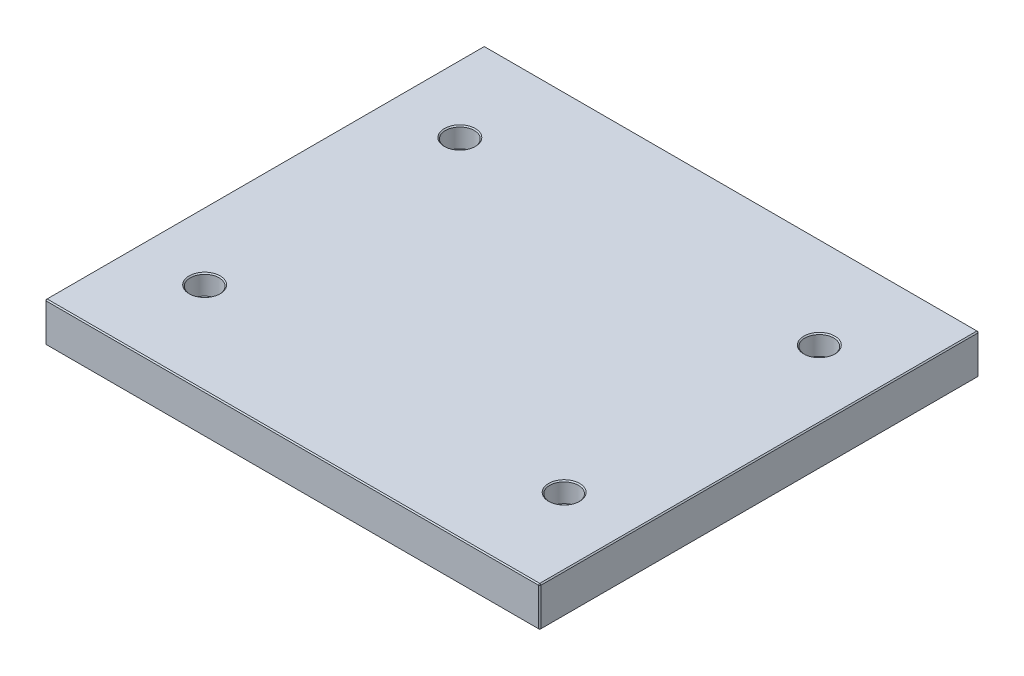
ISO-10303-21;
HEADER;
FILE_DESCRIPTION(('STEP AP214'),'2;1');
FILE_NAME('part.step','',(''),(''),'','','');
FILE_SCHEMA(('AUTOMOTIVE_DESIGN { 1 0 10303 214 1 1 1 1 }'));
ENDSEC;
DATA;
#1=APPLICATION_CONTEXT('core data for automotive mechanical design processes');
#2=APPLICATION_PROTOCOL_DEFINITION('international standard','automotive_design',2000,#1);
#3=PRODUCT_CONTEXT('',#1,'mechanical');
#4=PRODUCT('Part','Part','',(#3));
#5=PRODUCT_RELATED_PRODUCT_CATEGORY('part','',(#4));
#6=PRODUCT_DEFINITION_FORMATION('','',#4);
#7=PRODUCT_DEFINITION_CONTEXT('part definition',#1,'design');
#8=PRODUCT_DEFINITION('design','',#6,#7);
#9=PRODUCT_DEFINITION_SHAPE('','',#8);
#10=(LENGTH_UNIT() NAMED_UNIT(*) SI_UNIT(.MILLI.,.METRE.));
#11=(NAMED_UNIT(*) PLANE_ANGLE_UNIT() SI_UNIT($,.RADIAN.));
#12=(NAMED_UNIT(*) SI_UNIT($,.STERADIAN.) SOLID_ANGLE_UNIT());
#13=UNCERTAINTY_MEASURE_WITH_UNIT(LENGTH_MEASURE(1.E-05),#10,'distance_accuracy_value','');
#14=(GEOMETRIC_REPRESENTATION_CONTEXT(3) GLOBAL_UNCERTAINTY_ASSIGNED_CONTEXT((#13)) GLOBAL_UNIT_ASSIGNED_CONTEXT((#10,
#11,#12)) REPRESENTATION_CONTEXT('',''));
#15=CARTESIAN_POINT('',(0.,0.,0.));
#16=DIRECTION('',(0.,0.,1.));
#17=DIRECTION('',(1.,0.,0.));
#18=AXIS2_PLACEMENT_3D('',#15,#16,#17);
#19=CARTESIAN_POINT('',(-223.,36.,198.));
#20=DIRECTION('',(1.,0.,0.));
#21=DIRECTION('',(0.,0.,-1.));
#22=AXIS2_PLACEMENT_3D('',#19,#20,#21);
#23=PLANE('',#22);
#24=DIRECTION('',(0.,-1.,0.));
#25=VECTOR('',#24,1.);
#26=CARTESIAN_POINT('',(-223.,36.,-197.));
#27=LINE('',#26,#25);
#28=CARTESIAN_POINT('',(-223.,35.,-197.));
#29=VERTEX_POINT('',#28);
#30=CARTESIAN_POINT('',(-223.,1.,-197.));
#31=VERTEX_POINT('',#30);
#32=EDGE_CURVE('E115',#29,#31,#27,.T.);
#33=ORIENTED_EDGE('',*,*,#32,.T.);
#34=DIRECTION('',(0.,0.,1.));
#35=VECTOR('',#34,1.);
#36=CARTESIAN_POINT('',(-223.,1.,198.));
#37=LINE('',#36,#35);
#38=CARTESIAN_POINT('',(-223.,1.,197.));
#39=VERTEX_POINT('',#38);
#40=EDGE_CURVE('E111',#31,#39,#37,.T.);
#41=ORIENTED_EDGE('',*,*,#40,.T.);
#42=DIRECTION('',(0.,1.,0.));
#43=VECTOR('',#42,1.);
#44=CARTESIAN_POINT('',(-223.,36.,197.));
#45=LINE('',#44,#43);
#46=CARTESIAN_POINT('',(-223.,35.,197.));
#47=VERTEX_POINT('',#46);
#48=EDGE_CURVE('E104',#39,#47,#45,.T.);
#49=ORIENTED_EDGE('',*,*,#48,.T.);
#50=DIRECTION('',(0.,0.,-1.));
#51=VECTOR('',#50,1.);
#52=CARTESIAN_POINT('',(-223.,35.,-198.));
#53=LINE('',#52,#51);
#54=EDGE_CURVE('E108',#47,#29,#53,.T.);
#55=ORIENTED_EDGE('',*,*,#54,.T.);
#56=EDGE_LOOP('',(#33,#41,#49,#55));
#57=FACE_BOUND('',#56,.T.);
#58=ADVANCED_FACE('F16',(#57),#23,.F.);
#59=CARTESIAN_POINT('',(223.,36.,198.));
#60=DIRECTION('',(0.,0.,-1.));
#61=DIRECTION('',(-1.,0.,0.));
#62=AXIS2_PLACEMENT_3D('',#59,#60,#61);
#63=PLANE('',#62);
#64=DIRECTION('',(-1.,0.,0.));
#65=VECTOR('',#64,1.);
#66=CARTESIAN_POINT('',(-223.,35.,198.));
#67=LINE('',#66,#65);
#68=CARTESIAN_POINT('',(222.,35.,198.));
#69=VERTEX_POINT('',#68);
#70=CARTESIAN_POINT('',(-222.,35.,198.));
#71=VERTEX_POINT('',#70);
#72=EDGE_CURVE('E170',#69,#71,#67,.T.);
#73=ORIENTED_EDGE('',*,*,#72,.T.);
#74=DIRECTION('',(0.,-1.,0.));
#75=VECTOR('',#74,1.);
#76=CARTESIAN_POINT('',(-222.,36.,198.));
#77=LINE('',#76,#75);
#78=CARTESIAN_POINT('',(-222.,1.00000000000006,198.));
#79=VERTEX_POINT('',#78);
#80=EDGE_CURVE('E123',#71,#79,#77,.T.);
#81=ORIENTED_EDGE('',*,*,#80,.T.);
#82=DIRECTION('',(1.,0.,0.));
#83=VECTOR('',#82,1.);
#84=CARTESIAN_POINT('',(223.,1.00000000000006,198.));
#85=LINE('',#84,#83);
#86=CARTESIAN_POINT('',(222.,1.00000000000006,198.));
#87=VERTEX_POINT('',#86);
#88=EDGE_CURVE('E174',#79,#87,#85,.T.);
#89=ORIENTED_EDGE('',*,*,#88,.T.);
#90=DIRECTION('',(0.,1.,0.));
#91=VECTOR('',#90,1.);
#92=CARTESIAN_POINT('',(222.,36.,198.));
#93=LINE('',#92,#91);
#94=EDGE_CURVE('E172',#87,#69,#93,.T.);
#95=ORIENTED_EDGE('',*,*,#94,.T.);
#96=EDGE_LOOP('',(#73,#81,#89,#95));
#97=FACE_BOUND('',#96,.T.);
#98=ADVANCED_FACE('F317',(#97),#63,.F.);
#99=CARTESIAN_POINT('',(223.,36.,198.));
#100=DIRECTION('',(-1.,0.,0.));
#101=DIRECTION('',(0.,0.,1.));
#102=AXIS2_PLACEMENT_3D('',#99,#100,#101);
#103=PLANE('',#102);
#104=DIRECTION('',(0.,0.,-1.));
#105=VECTOR('',#104,1.);
#106=CARTESIAN_POINT('',(223.,1.00000000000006,198.));
#107=LINE('',#106,#105);
#108=CARTESIAN_POINT('',(223.,1.00000000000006,197.));
#109=VERTEX_POINT('',#108);
#110=CARTESIAN_POINT('',(223.,1.00000000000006,-197.));
#111=VERTEX_POINT('',#110);
#112=EDGE_CURVE('E165',#109,#111,#107,.T.);
#113=ORIENTED_EDGE('',*,*,#112,.T.);
#114=DIRECTION('',(0.,1.,0.));
#115=VECTOR('',#114,1.);
#116=CARTESIAN_POINT('',(223.,36.,-197.));
#117=LINE('',#116,#115);
#118=CARTESIAN_POINT('',(223.,35.,-197.));
#119=VERTEX_POINT('',#118);
#120=EDGE_CURVE('E167',#111,#119,#117,.T.);
#121=ORIENTED_EDGE('',*,*,#120,.T.);
#122=DIRECTION('',(0.,0.,1.));
#123=VECTOR('',#122,1.);
#124=CARTESIAN_POINT('',(223.,35.,198.));
#125=LINE('',#124,#123);
#126=CARTESIAN_POINT('',(223.,35.,197.));
#127=VERTEX_POINT('',#126);
#128=EDGE_CURVE('E161',#119,#127,#125,.T.);
#129=ORIENTED_EDGE('',*,*,#128,.T.);
#130=DIRECTION('',(0.,-1.,0.));
#131=VECTOR('',#130,1.);
#132=CARTESIAN_POINT('',(223.,36.,197.));
#133=LINE('',#132,#131);
#134=EDGE_CURVE('E163',#127,#109,#133,.T.);
#135=ORIENTED_EDGE('',*,*,#134,.T.);
#136=EDGE_LOOP('',(#113,#121,#129,#135));
#137=FACE_BOUND('',#136,.T.);
#138=ADVANCED_FACE('F323',(#137),#103,.F.);
#139=CARTESIAN_POINT('',(223.,36.,-198.));
#140=DIRECTION('',(0.,0.,1.));
#141=DIRECTION('',(1.,0.,0.));
#142=AXIS2_PLACEMENT_3D('',#139,#140,#141);
#143=PLANE('',#142);
#144=DIRECTION('',(0.,-1.,0.));
#145=VECTOR('',#144,1.);
#146=CARTESIAN_POINT('',(222.,36.,-198.));
#147=LINE('',#146,#145);
#148=CARTESIAN_POINT('',(222.,35.,-198.));
#149=VERTEX_POINT('',#148);
#150=CARTESIAN_POINT('',(222.,1.00000000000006,-198.));
#151=VERTEX_POINT('',#150);
#152=EDGE_CURVE('E154',#149,#151,#147,.T.);
#153=ORIENTED_EDGE('',*,*,#152,.T.);
#154=DIRECTION('',(-1.,0.,0.));
#155=VECTOR('',#154,1.);
#156=CARTESIAN_POINT('',(223.,1.00000000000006,-198.));
#157=LINE('',#156,#155);
#158=CARTESIAN_POINT('',(-222.,1.00000000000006,-198.));
#159=VERTEX_POINT('',#158);
#160=EDGE_CURVE('E159',#151,#159,#157,.T.);
#161=ORIENTED_EDGE('',*,*,#160,.T.);
#162=DIRECTION('',(0.,1.,0.));
#163=VECTOR('',#162,1.);
#164=CARTESIAN_POINT('',(-222.,36.,-198.));
#165=LINE('',#164,#163);
#166=CARTESIAN_POINT('',(-222.,35.,-198.));
#167=VERTEX_POINT('',#166);
#168=EDGE_CURVE('E156',#159,#167,#165,.T.);
#169=ORIENTED_EDGE('',*,*,#168,.T.);
#170=DIRECTION('',(1.,0.,0.));
#171=VECTOR('',#170,1.);
#172=CARTESIAN_POINT('',(223.,35.,-198.));
#173=LINE('',#172,#171);
#174=EDGE_CURVE('E152',#167,#149,#173,.T.);
#175=ORIENTED_EDGE('',*,*,#174,.T.);
#176=EDGE_LOOP('',(#153,#161,#169,#175));
#177=FACE_BOUND('',#176,.T.);
#178=ADVANCED_FACE('F465',(#177),#143,.F.);
#179=CARTESIAN_POINT('',(0.,36.,0.));
#180=DIRECTION('',(0.,1.,0.));
#181=DIRECTION('',(0.,0.,1.));
#182=AXIS2_PLACEMENT_3D('',#179,#180,#181);
#183=PLANE('',#182);
#184=CARTESIAN_POINT('',(-162.,36.,115.));
#185=DIRECTION('',(0.,1.,0.));
#186=DIRECTION('',(0.,0.,1.));
#187=AXIS2_PLACEMENT_3D('',#184,#185,#186);
#188=CIRCLE('',#187,14.);
#189=CARTESIAN_POINT('',(-162.,36.,129.));
#190=VERTEX_POINT('',#189);
#191=EDGE_CURVE('E290',#190,#190,#188,.F.);
#192=ORIENTED_EDGE('',*,*,#191,.T.);
#193=EDGE_LOOP('',(#192));
#194=FACE_BOUND('',#193,.T.);
#195=CARTESIAN_POINT('',(162.,36.,115.));
#196=DIRECTION('',(0.,1.,0.));
#197=DIRECTION('',(0.,0.,1.));
#198=AXIS2_PLACEMENT_3D('',#195,#196,#197);
#199=CIRCLE('',#198,14.);
#200=CARTESIAN_POINT('',(162.,36.,129.));
#201=VERTEX_POINT('',#200);
#202=EDGE_CURVE('E287',#201,#201,#199,.F.);
#203=ORIENTED_EDGE('',*,*,#202,.T.);
#204=EDGE_LOOP('',(#203));
#205=FACE_BOUND('',#204,.T.);
#206=CARTESIAN_POINT('',(162.,36.,-115.));
#207=DIRECTION('',(0.,1.,0.));
#208=DIRECTION('',(0.,0.,1.));
#209=AXIS2_PLACEMENT_3D('',#206,#207,#208);
#210=CIRCLE('',#209,14.);
#211=CARTESIAN_POINT('',(162.,36.,-101.));
#212=VERTEX_POINT('',#211);
#213=EDGE_CURVE('E284',#212,#212,#210,.F.);
#214=ORIENTED_EDGE('',*,*,#213,.T.);
#215=EDGE_LOOP('',(#214));
#216=FACE_BOUND('',#215,.T.);
#217=CARTESIAN_POINT('',(-162.,36.,-115.));
#218=DIRECTION('',(0.,1.,0.));
#219=DIRECTION('',(0.,0.,1.));
#220=AXIS2_PLACEMENT_3D('',#217,#218,#219);
#221=CIRCLE('',#220,14.);
#222=CARTESIAN_POINT('',(-162.,36.,-101.));
#223=VERTEX_POINT('',#222);
#224=EDGE_CURVE('E281',#223,#223,#221,.F.);
#225=ORIENTED_EDGE('',*,*,#224,.T.);
#226=EDGE_LOOP('',(#225));
#227=FACE_BOUND('',#226,.T.);
#228=DIRECTION('',(0.,0.,-1.));
#229=VECTOR('',#228,1.);
#230=CARTESIAN_POINT('',(222.,36.,-198.));
#231=LINE('',#230,#229);
#232=CARTESIAN_POINT('',(222.,36.,197.));
#233=VERTEX_POINT('',#232);
#234=CARTESIAN_POINT('',(222.,36.,-197.));
#235=VERTEX_POINT('',#234);
#236=EDGE_CURVE('E31',#233,#235,#231,.T.);
#237=ORIENTED_EDGE('',*,*,#236,.T.);
#238=DIRECTION('',(-1.,0.,0.));
#239=VECTOR('',#238,1.);
#240=CARTESIAN_POINT('',(-223.,36.,-197.));
#241=LINE('',#240,#239);
#242=CARTESIAN_POINT('',(-222.,36.,-197.));
#243=VERTEX_POINT('',#242);
#244=EDGE_CURVE('E190',#235,#243,#241,.T.);
#245=ORIENTED_EDGE('',*,*,#244,.T.);
#246=DIRECTION('',(0.,0.,1.));
#247=VECTOR('',#246,1.);
#248=CARTESIAN_POINT('',(-222.,36.,198.));
#249=LINE('',#248,#247);
#250=CARTESIAN_POINT('',(-222.,36.,197.));
#251=VERTEX_POINT('',#250);
#252=EDGE_CURVE('E186',#243,#251,#249,.T.);
#253=ORIENTED_EDGE('',*,*,#252,.T.);
#254=DIRECTION('',(1.,0.,0.));
#255=VECTOR('',#254,1.);
#256=CARTESIAN_POINT('',(223.,36.,197.));
#257=LINE('',#256,#255);
#258=EDGE_CURVE('E36',#251,#233,#257,.T.);
#259=ORIENTED_EDGE('',*,*,#258,.T.);
#260=EDGE_LOOP('',(#237,#245,#253,#259));
#261=FACE_BOUND('',#260,.T.);
#262=ADVANCED_FACE('F462',(#194,#205,#216,#227,#261),#183,.T.);
#263=CARTESIAN_POINT('',(0.,0.,0.));
#264=DIRECTION('',(0.,1.,0.));
#265=DIRECTION('',(0.,0.,1.));
#266=AXIS2_PLACEMENT_3D('',#263,#264,#265);
#267=PLANE('',#266);
#268=CARTESIAN_POINT('',(162.,0.,-115.));
#269=DIRECTION('',(0.,1.,0.));
#270=DIRECTION('',(0.,0.,1.));
#271=AXIS2_PLACEMENT_3D('',#268,#269,#270);
#272=CIRCLE('',#271,10.);
#273=CARTESIAN_POINT('',(162.,0.,-105.));
#274=VERTEX_POINT('',#273);
#275=EDGE_CURVE('E263',#274,#274,#272,.T.);
#276=ORIENTED_EDGE('',*,*,#275,.T.);
#277=EDGE_LOOP('',(#276));
#278=FACE_BOUND('',#277,.T.);
#279=CARTESIAN_POINT('',(162.,0.,115.));
#280=DIRECTION('',(0.,1.,0.));
#281=DIRECTION('',(0.,0.,1.));
#282=AXIS2_PLACEMENT_3D('',#279,#280,#281);
#283=CIRCLE('',#282,10.);
#284=CARTESIAN_POINT('',(162.,0.,125.));
#285=VERTEX_POINT('',#284);
#286=EDGE_CURVE('E260',#285,#285,#283,.T.);
#287=ORIENTED_EDGE('',*,*,#286,.T.);
#288=EDGE_LOOP('',(#287));
#289=FACE_BOUND('',#288,.T.);
#290=CARTESIAN_POINT('',(-162.,0.,115.));
#291=DIRECTION('',(0.,1.,0.));
#292=DIRECTION('',(0.,0.,1.));
#293=AXIS2_PLACEMENT_3D('',#290,#291,#292);
#294=CIRCLE('',#293,10.);
#295=CARTESIAN_POINT('',(-162.,0.,125.));
#296=VERTEX_POINT('',#295);
#297=EDGE_CURVE('E257',#296,#296,#294,.T.);
#298=ORIENTED_EDGE('',*,*,#297,.T.);
#299=EDGE_LOOP('',(#298));
#300=FACE_BOUND('',#299,.T.);
#301=CARTESIAN_POINT('',(-162.,0.,-115.));
#302=DIRECTION('',(0.,1.,0.));
#303=DIRECTION('',(0.,0.,1.));
#304=AXIS2_PLACEMENT_3D('',#301,#302,#303);
#305=CIRCLE('',#304,10.);
#306=CARTESIAN_POINT('',(-162.,0.,-105.));
#307=VERTEX_POINT('',#306);
#308=EDGE_CURVE('E192',#307,#307,#305,.T.);
#309=ORIENTED_EDGE('',*,*,#308,.T.);
#310=EDGE_LOOP('',(#309));
#311=FACE_BOUND('',#310,.T.);
#312=DIRECTION('',(0.,0.,1.));
#313=VECTOR('',#312,1.);
#314=CARTESIAN_POINT('',(222.,0.,0.));
#315=LINE('',#314,#313);
#316=CARTESIAN_POINT('',(222.,0.,-197.));
#317=VERTEX_POINT('',#316);
#318=CARTESIAN_POINT('',(222.,0.,197.));
#319=VERTEX_POINT('',#318);
#320=EDGE_CURVE('E177',#317,#319,#315,.T.);
#321=ORIENTED_EDGE('',*,*,#320,.T.);
#322=DIRECTION('',(-1.,0.,0.));
#323=VECTOR('',#322,1.);
#324=CARTESIAN_POINT('',(0.,0.,197.));
#325=LINE('',#324,#323);
#326=CARTESIAN_POINT('',(-222.,0.,197.));
#327=VERTEX_POINT('',#326);
#328=EDGE_CURVE('E183',#319,#327,#325,.T.);
#329=ORIENTED_EDGE('',*,*,#328,.T.);
#330=DIRECTION('',(0.,0.,-1.));
#331=VECTOR('',#330,1.);
#332=CARTESIAN_POINT('',(-222.,0.,0.));
#333=LINE('',#332,#331);
#334=CARTESIAN_POINT('',(-222.,0.,-197.));
#335=VERTEX_POINT('',#334);
#336=EDGE_CURVE('E181',#327,#335,#333,.T.);
#337=ORIENTED_EDGE('',*,*,#336,.T.);
#338=DIRECTION('',(1.,0.,0.));
#339=VECTOR('',#338,1.);
#340=CARTESIAN_POINT('',(0.,0.,-197.));
#341=LINE('',#340,#339);
#342=EDGE_CURVE('E179',#335,#317,#341,.T.);
#343=ORIENTED_EDGE('',*,*,#342,.T.);
#344=EDGE_LOOP('',(#321,#329,#337,#343));
#345=FACE_BOUND('',#344,.T.);
#346=ADVANCED_FACE('F402',(#278,#289,#300,#311,#345),#267,.F.);
#347=CARTESIAN_POINT('',(223.,36.,197.));
#348=DIRECTION('',(-0.707106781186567,0.,-0.707106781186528));
#349=DIRECTION('',(0.,-1.,0.));
#350=AXIS2_PLACEMENT_3D('',#347,#348,#349);
#351=PLANE('',#350);
#352=DIRECTION('',(-0.707106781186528,0.,0.707106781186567));
#353=VECTOR('',#352,1.);
#354=CARTESIAN_POINT('',(222.,35.,198.));
#355=LINE('',#354,#353);
#356=EDGE_CURVE('E141',#69,#127,#355,.F.);
#357=ORIENTED_EDGE('',*,*,#356,.F.);
#358=ORIENTED_EDGE('',*,*,#94,.F.);
#359=DIRECTION('',(0.707106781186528,0.,-0.707106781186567));
#360=VECTOR('',#359,1.);
#361=CARTESIAN_POINT('',(222.,1.00000000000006,198.));
#362=LINE('',#361,#360);
#363=EDGE_CURVE('E144',#109,#87,#362,.F.);
#364=ORIENTED_EDGE('',*,*,#363,.F.);
#365=ORIENTED_EDGE('',*,*,#134,.F.);
#366=EDGE_LOOP('',(#357,#358,#364,#365));
#367=FACE_BOUND('',#366,.T.);
#368=ADVANCED_FACE('F398',(#367),#351,.F.);
#369=CARTESIAN_POINT('',(222.,35.,198.));
#370=DIRECTION('',(0.577350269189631,0.577350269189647,0.577350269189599));
#371=DIRECTION('',(-0.707106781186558,0.707106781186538,0.));
#372=AXIS2_PLACEMENT_3D('',#369,#370,#371);
#373=PLANE('',#372);
#374=DIRECTION('',(0.,-0.707106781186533,0.707106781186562));
#375=VECTOR('',#374,1.);
#376=CARTESIAN_POINT('',(222.,35.,198.));
#377=LINE('',#376,#375);
#378=EDGE_CURVE('E235',#69,#233,#377,.F.);
#379=ORIENTED_EDGE('',*,*,#378,.F.);
#380=ORIENTED_EDGE('',*,*,#356,.T.);
#381=DIRECTION('',(-0.707106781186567,0.707106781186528,0.));
#382=VECTOR('',#381,1.);
#383=CARTESIAN_POINT('',(222.5,35.5,197.));
#384=LINE('',#383,#382);
#385=EDGE_CURVE('E237',#233,#127,#384,.F.);
#386=ORIENTED_EDGE('',*,*,#385,.F.);
#387=EDGE_LOOP('',(#379,#380,#386));
#388=FACE_BOUND('',#387,.T.);
#389=ADVANCED_FACE('F394',(#388),#373,.T.);
#390=CARTESIAN_POINT('',(222.,1.00000000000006,198.));
#391=DIRECTION('',(0.577350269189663,-0.577350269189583,0.577350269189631));
#392=DIRECTION('',(0.707106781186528,0.,-0.707106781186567));
#393=AXIS2_PLACEMENT_3D('',#390,#391,#392);
#394=PLANE('',#393);
#395=DIRECTION('',(-0.707106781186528,-0.707106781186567,0.));
#396=VECTOR('',#395,1.);
#397=CARTESIAN_POINT('',(222.5,0.500000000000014,197.));
#398=LINE('',#397,#396);
#399=EDGE_CURVE('E229',#109,#319,#398,.T.);
#400=ORIENTED_EDGE('',*,*,#399,.F.);
#401=ORIENTED_EDGE('',*,*,#363,.T.);
#402=DIRECTION('',(0.,0.707106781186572,0.707106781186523));
#403=VECTOR('',#402,1.);
#404=CARTESIAN_POINT('',(222.,1.00000000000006,198.));
#405=LINE('',#404,#403);
#406=EDGE_CURVE('E232',#319,#87,#405,.T.);
#407=ORIENTED_EDGE('',*,*,#406,.F.);
#408=EDGE_LOOP('',(#400,#401,#407));
#409=FACE_BOUND('',#408,.T.);
#410=ADVANCED_FACE('F390',(#409),#394,.T.);
#411=CARTESIAN_POINT('',(222.,36.,0.));
#412=DIRECTION('',(0.707106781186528,0.707106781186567,0.));
#413=DIRECTION('',(0.,0.,1.));
#414=AXIS2_PLACEMENT_3D('',#411,#412,#413);
#415=PLANE('',#414);
#416=ORIENTED_EDGE('',*,*,#385,.T.);
#417=ORIENTED_EDGE('',*,*,#128,.F.);
#418=DIRECTION('',(0.707106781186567,-0.707106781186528,0.));
#419=VECTOR('',#418,1.);
#420=CARTESIAN_POINT('',(223.,35.,-197.));
#421=LINE('',#420,#419);
#422=EDGE_CURVE('E224',#235,#119,#421,.T.);
#423=ORIENTED_EDGE('',*,*,#422,.F.);
#424=ORIENTED_EDGE('',*,*,#236,.F.);
#425=EDGE_LOOP('',(#416,#417,#423,#424));
#426=FACE_BOUND('',#425,.T.);
#427=ADVANCED_FACE('F386',(#426),#415,.T.);
#428=CARTESIAN_POINT('',(0.,36.,197.));
#429=DIRECTION('',(0.,0.707106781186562,0.707106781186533));
#430=DIRECTION('',(-1.,0.,0.));
#431=AXIS2_PLACEMENT_3D('',#428,#429,#430);
#432=PLANE('',#431);
#433=ORIENTED_EDGE('',*,*,#378,.T.);
#434=ORIENTED_EDGE('',*,*,#258,.F.);
#435=DIRECTION('',(0.,0.707106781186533,-0.707106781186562));
#436=VECTOR('',#435,1.);
#437=CARTESIAN_POINT('',(-222.,35.5,197.5));
#438=LINE('',#437,#436);
#439=EDGE_CURVE('E127',#71,#251,#438,.T.);
#440=ORIENTED_EDGE('',*,*,#439,.F.);
#441=ORIENTED_EDGE('',*,*,#72,.F.);
#442=EDGE_LOOP('',(#433,#434,#440,#441));
#443=FACE_BOUND('',#442,.T.);
#444=ADVANCED_FACE('F383',(#443),#432,.T.);
#445=CARTESIAN_POINT('',(-222.,36.,198.));
#446=DIRECTION('',(0.707106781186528,0.,-0.707106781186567));
#447=DIRECTION('',(0.,-1.,0.));
#448=AXIS2_PLACEMENT_3D('',#445,#446,#447);
#449=PLANE('',#448);
#450=DIRECTION('',(0.707106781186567,0.,0.707106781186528));
#451=VECTOR('',#450,1.);
#452=CARTESIAN_POINT('',(-222.,1.00000000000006,198.));
#453=LINE('',#452,#451);
#454=EDGE_CURVE('E128',#79,#39,#453,.F.);
#455=ORIENTED_EDGE('',*,*,#454,.F.);
#456=ORIENTED_EDGE('',*,*,#80,.F.);
#457=DIRECTION('',(-0.707106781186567,0.,-0.707106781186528));
#458=VECTOR('',#457,1.);
#459=CARTESIAN_POINT('',(-223.,35.,197.));
#460=LINE('',#459,#458);
#461=EDGE_CURVE('E119',#47,#71,#460,.F.);
#462=ORIENTED_EDGE('',*,*,#461,.F.);
#463=ORIENTED_EDGE('',*,*,#48,.F.);
#464=EDGE_LOOP('',(#455,#456,#462,#463));
#465=FACE_BOUND('',#464,.T.);
#466=ADVANCED_FACE('F121',(#465),#449,.F.);
#467=CARTESIAN_POINT('',(223.,1.00000000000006,198.));
#468=DIRECTION('',(0.,0.707106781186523,-0.707106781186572));
#469=DIRECTION('',(1.,0.,0.));
#470=AXIS2_PLACEMENT_3D('',#467,#468,#469);
#471=PLANE('',#470);
#472=ORIENTED_EDGE('',*,*,#406,.T.);
#473=ORIENTED_EDGE('',*,*,#88,.F.);
#474=DIRECTION('',(0.,-0.707106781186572,-0.707106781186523));
#475=VECTOR('',#474,1.);
#476=CARTESIAN_POINT('',(-222.,1.00000000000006,198.));
#477=LINE('',#476,#475);
#478=EDGE_CURVE('E220',#327,#79,#477,.F.);
#479=ORIENTED_EDGE('',*,*,#478,.F.);
#480=ORIENTED_EDGE('',*,*,#328,.F.);
#481=EDGE_LOOP('',(#472,#473,#479,#480));
#482=FACE_BOUND('',#481,.T.);
#483=ADVANCED_FACE('F376',(#482),#471,.F.);
#484=CARTESIAN_POINT('',(223.,1.00000000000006,198.));
#485=DIRECTION('',(-0.707106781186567,0.707106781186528,0.));
#486=DIRECTION('',(0.,0.,-1.));
#487=AXIS2_PLACEMENT_3D('',#484,#485,#486);
#488=PLANE('',#487);
#489=ORIENTED_EDGE('',*,*,#399,.T.);
#490=ORIENTED_EDGE('',*,*,#320,.F.);
#491=DIRECTION('',(0.707106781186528,0.707106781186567,0.));
#492=VECTOR('',#491,1.);
#493=CARTESIAN_POINT('',(222.5,0.500000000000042,-197.));
#494=LINE('',#493,#492);
#495=EDGE_CURVE('E217',#111,#317,#494,.F.);
#496=ORIENTED_EDGE('',*,*,#495,.F.);
#497=ORIENTED_EDGE('',*,*,#112,.F.);
#498=EDGE_LOOP('',(#489,#490,#496,#497));
#499=FACE_BOUND('',#498,.T.);
#500=ADVANCED_FACE('F372',(#499),#488,.F.);
#501=CARTESIAN_POINT('',(222.,36.,-198.));
#502=DIRECTION('',(-0.707106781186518,0.,0.707106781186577));
#503=DIRECTION('',(0.,-1.,0.));
#504=AXIS2_PLACEMENT_3D('',#501,#502,#503);
#505=PLANE('',#504);
#506=DIRECTION('',(0.707106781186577,0.,0.707106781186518));
#507=VECTOR('',#506,1.);
#508=CARTESIAN_POINT('',(223.,35.,-197.));
#509=LINE('',#508,#507);
#510=EDGE_CURVE('E226',#119,#149,#509,.F.);
#511=ORIENTED_EDGE('',*,*,#510,.F.);
#512=ORIENTED_EDGE('',*,*,#120,.F.);
#513=DIRECTION('',(-0.707106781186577,0.,-0.707106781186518));
#514=VECTOR('',#513,1.);
#515=CARTESIAN_POINT('',(222.,1.00000000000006,-198.));
#516=LINE('',#515,#514);
#517=EDGE_CURVE('E214',#151,#111,#516,.F.);
#518=ORIENTED_EDGE('',*,*,#517,.F.);
#519=ORIENTED_EDGE('',*,*,#152,.F.);
#520=EDGE_LOOP('',(#511,#512,#518,#519));
#521=FACE_BOUND('',#520,.T.);
#522=ADVANCED_FACE('F368',(#521),#505,.F.);
#523=CARTESIAN_POINT('',(223.,35.,-197.));
#524=DIRECTION('',(0.577350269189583,0.577350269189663,-0.577350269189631));
#525=DIRECTION('',(0.,0.707106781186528,0.707106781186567));
#526=AXIS2_PLACEMENT_3D('',#523,#524,#525);
#527=PLANE('',#526);
#528=ORIENTED_EDGE('',*,*,#422,.T.);
#529=ORIENTED_EDGE('',*,*,#510,.T.);
#530=DIRECTION('',(0.,0.707106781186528,0.707106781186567));
#531=VECTOR('',#530,1.);
#532=CARTESIAN_POINT('',(222.,35.5,-197.5));
#533=LINE('',#532,#531);
#534=EDGE_CURVE('E135',#235,#149,#533,.F.);
#535=ORIENTED_EDGE('',*,*,#534,.F.);
#536=EDGE_LOOP('',(#528,#529,#535));
#537=FACE_BOUND('',#536,.T.);
#538=ADVANCED_FACE('F365',(#537),#527,.T.);
#539=CARTESIAN_POINT('',(-223.,35.,197.));
#540=DIRECTION('',(-0.577350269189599,0.577350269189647,0.577350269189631));
#541=DIRECTION('',(0.,-0.707106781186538,0.707106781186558));
#542=AXIS2_PLACEMENT_3D('',#539,#540,#541);
#543=PLANE('',#542);
#544=ORIENTED_EDGE('',*,*,#461,.T.);
#545=ORIENTED_EDGE('',*,*,#439,.T.);
#546=DIRECTION('',(-0.707106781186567,-0.707106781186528,0.));
#547=VECTOR('',#546,1.);
#548=CARTESIAN_POINT('',(-223.,35.,197.));
#549=LINE('',#548,#547);
#550=EDGE_CURVE('E131',#47,#251,#549,.F.);
#551=ORIENTED_EDGE('',*,*,#550,.F.);
#552=EDGE_LOOP('',(#544,#545,#551));
#553=FACE_BOUND('',#552,.T.);
#554=ADVANCED_FACE('F132',(#553),#543,.T.);
#555=CARTESIAN_POINT('',(-222.,1.00000000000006,198.));
#556=DIRECTION('',(-0.577350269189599,-0.577350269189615,0.577350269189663));
#557=DIRECTION('',(0.,-0.707106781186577,-0.707106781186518));
#558=AXIS2_PLACEMENT_3D('',#555,#556,#557);
#559=PLANE('',#558);
#560=ORIENTED_EDGE('',*,*,#478,.T.);
#561=ORIENTED_EDGE('',*,*,#454,.T.);
#562=DIRECTION('',(-0.707106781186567,0.707106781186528,0.));
#563=VECTOR('',#562,1.);
#564=CARTESIAN_POINT('',(-222.5,0.499999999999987,197.));
#565=LINE('',#564,#563);
#566=EDGE_CURVE('E136',#327,#39,#565,.T.);
#567=ORIENTED_EDGE('',*,*,#566,.F.);
#568=EDGE_LOOP('',(#560,#561,#567));
#569=FACE_BOUND('',#568,.T.);
#570=ADVANCED_FACE('F358',(#569),#559,.T.);
#571=CARTESIAN_POINT('',(222.,1.00000000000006,-198.));
#572=DIRECTION('',(0.577350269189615,-0.577350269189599,-0.577350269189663));
#573=DIRECTION('',(-0.707106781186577,0.,-0.707106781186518));
#574=AXIS2_PLACEMENT_3D('',#571,#572,#573);
#575=PLANE('',#574);
#576=ORIENTED_EDGE('',*,*,#517,.T.);
#577=ORIENTED_EDGE('',*,*,#495,.T.);
#578=DIRECTION('',(0.,-0.707106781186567,0.707106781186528));
#579=VECTOR('',#578,1.);
#580=CARTESIAN_POINT('',(222.,1.00000000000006,-198.));
#581=LINE('',#580,#579);
#582=EDGE_CURVE('E207',#151,#317,#581,.T.);
#583=ORIENTED_EDGE('',*,*,#582,.F.);
#584=EDGE_LOOP('',(#576,#577,#583));
#585=FACE_BOUND('',#584,.T.);
#586=ADVANCED_FACE('F354',(#585),#575,.T.);
#587=CARTESIAN_POINT('',(0.,36.,-197.));
#588=DIRECTION('',(0.,0.707106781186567,-0.707106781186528));
#589=DIRECTION('',(1.,0.,0.));
#590=AXIS2_PLACEMENT_3D('',#587,#588,#589);
#591=PLANE('',#590);
#592=ORIENTED_EDGE('',*,*,#534,.T.);
#593=ORIENTED_EDGE('',*,*,#174,.F.);
#594=DIRECTION('',(0.,-0.707106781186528,-0.707106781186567));
#595=VECTOR('',#594,1.);
#596=CARTESIAN_POINT('',(-222.,35.,-198.));
#597=LINE('',#596,#595);
#598=EDGE_CURVE('E204',#243,#167,#597,.T.);
#599=ORIENTED_EDGE('',*,*,#598,.F.);
#600=ORIENTED_EDGE('',*,*,#244,.F.);
#601=EDGE_LOOP('',(#592,#593,#599,#600));
#602=FACE_BOUND('',#601,.T.);
#603=ADVANCED_FACE('F351',(#602),#591,.T.);
#604=CARTESIAN_POINT('',(-222.,36.,0.));
#605=DIRECTION('',(-0.707106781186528,0.707106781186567,0.));
#606=DIRECTION('',(0.,0.,-1.));
#607=AXIS2_PLACEMENT_3D('',#604,#605,#606);
#608=PLANE('',#607);
#609=ORIENTED_EDGE('',*,*,#550,.T.);
#610=ORIENTED_EDGE('',*,*,#252,.F.);
#611=DIRECTION('',(0.707106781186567,0.707106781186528,0.));
#612=VECTOR('',#611,1.);
#613=CARTESIAN_POINT('',(-222.5,35.5,-197.));
#614=LINE('',#613,#612);
#615=EDGE_CURVE('E139',#29,#243,#614,.T.);
#616=ORIENTED_EDGE('',*,*,#615,.F.);
#617=ORIENTED_EDGE('',*,*,#54,.F.);
#618=EDGE_LOOP('',(#609,#610,#616,#617));
#619=FACE_BOUND('',#618,.T.);
#620=ADVANCED_FACE('F138',(#619),#608,.T.);
#621=CARTESIAN_POINT('',(-223.,1.,198.));
#622=DIRECTION('',(0.707106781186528,0.707106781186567,0.));
#623=DIRECTION('',(0.,0.,1.));
#624=AXIS2_PLACEMENT_3D('',#621,#622,#623);
#625=PLANE('',#624);
#626=ORIENTED_EDGE('',*,*,#566,.T.);
#627=ORIENTED_EDGE('',*,*,#40,.F.);
#628=DIRECTION('',(0.707106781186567,-0.707106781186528,0.));
#629=VECTOR('',#628,1.);
#630=CARTESIAN_POINT('',(-223.,1.,-197.));
#631=LINE('',#630,#629);
#632=EDGE_CURVE('E200',#335,#31,#631,.F.);
#633=ORIENTED_EDGE('',*,*,#632,.F.);
#634=ORIENTED_EDGE('',*,*,#336,.F.);
#635=EDGE_LOOP('',(#626,#627,#633,#634));
#636=FACE_BOUND('',#635,.T.);
#637=ADVANCED_FACE('F344',(#636),#625,.F.);
#638=CARTESIAN_POINT('',(223.,1.00000000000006,-198.));
#639=DIRECTION('',(0.,0.707106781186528,0.707106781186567));
#640=DIRECTION('',(-1.,0.,0.));
#641=AXIS2_PLACEMENT_3D('',#638,#639,#640);
#642=PLANE('',#641);
#643=ORIENTED_EDGE('',*,*,#582,.T.);
#644=ORIENTED_EDGE('',*,*,#342,.F.);
#645=DIRECTION('',(0.,0.707106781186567,-0.707106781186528));
#646=VECTOR('',#645,1.);
#647=CARTESIAN_POINT('',(-222.,0.500000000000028,-197.5));
#648=LINE('',#647,#646);
#649=EDGE_CURVE('E197',#159,#335,#648,.F.);
#650=ORIENTED_EDGE('',*,*,#649,.F.);
#651=ORIENTED_EDGE('',*,*,#160,.F.);
#652=EDGE_LOOP('',(#643,#644,#650,#651));
#653=FACE_BOUND('',#652,.T.);
#654=ADVANCED_FACE('F340',(#653),#642,.F.);
#655=CARTESIAN_POINT('',(-222.,35.,-198.));
#656=DIRECTION('',(-0.577350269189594,0.577350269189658,-0.577350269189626));
#657=DIRECTION('',(0.,0.707106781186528,0.707106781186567));
#658=AXIS2_PLACEMENT_3D('',#655,#656,#657);
#659=PLANE('',#658);
#660=ORIENTED_EDGE('',*,*,#615,.T.);
#661=ORIENTED_EDGE('',*,*,#598,.T.);
#662=DIRECTION('',(0.707106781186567,0.,-0.707106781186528));
#663=VECTOR('',#662,1.);
#664=CARTESIAN_POINT('',(-222.,35.,-198.));
#665=LINE('',#664,#663);
#666=EDGE_CURVE('E195',#29,#167,#665,.T.);
#667=ORIENTED_EDGE('',*,*,#666,.F.);
#668=EDGE_LOOP('',(#660,#661,#667));
#669=FACE_BOUND('',#668,.T.);
#670=ADVANCED_FACE('F336',(#669),#659,.T.);
#671=CARTESIAN_POINT('',(-223.,1.,-197.));
#672=DIRECTION('',(-0.577350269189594,-0.577350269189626,-0.577350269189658));
#673=DIRECTION('',(0.,0.707106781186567,-0.707106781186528));
#674=AXIS2_PLACEMENT_3D('',#671,#672,#673);
#675=PLANE('',#674);
#676=ORIENTED_EDGE('',*,*,#649,.T.);
#677=ORIENTED_EDGE('',*,*,#632,.T.);
#678=DIRECTION('',(-0.707106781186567,0.,0.707106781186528));
#679=VECTOR('',#678,1.);
#680=CARTESIAN_POINT('',(-223.,1.,-197.));
#681=LINE('',#680,#679);
#682=EDGE_CURVE('E193',#159,#31,#681,.T.);
#683=ORIENTED_EDGE('',*,*,#682,.F.);
#684=EDGE_LOOP('',(#676,#677,#683));
#685=FACE_BOUND('',#684,.T.);
#686=ADVANCED_FACE('F332',(#685),#675,.T.);
#687=CARTESIAN_POINT('',(-223.,36.,-197.));
#688=DIRECTION('',(0.707106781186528,0.,0.707106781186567));
#689=DIRECTION('',(0.,-1.,0.));
#690=AXIS2_PLACEMENT_3D('',#687,#688,#689);
#691=PLANE('',#690);
#692=ORIENTED_EDGE('',*,*,#666,.T.);
#693=ORIENTED_EDGE('',*,*,#168,.F.);
#694=ORIENTED_EDGE('',*,*,#682,.T.);
#695=ORIENTED_EDGE('',*,*,#32,.F.);
#696=EDGE_LOOP('',(#692,#693,#694,#695));
#697=FACE_BOUND('',#696,.T.);
#698=ADVANCED_FACE('F328',(#697),#691,.F.);
#699=CARTESIAN_POINT('',(-162.,18.,-115.));
#700=DIRECTION('',(0.,1.,0.));
#701=DIRECTION('',(0.,0.,1.));
#702=AXIS2_PLACEMENT_3D('',#699,#700,#701);
#703=CYLINDRICAL_SURFACE('',#702,13.);
#704=CARTESIAN_POINT('',(-162.,35.,-115.));
#705=DIRECTION('',(0.,1.,0.));
#706=DIRECTION('',(0.,0.,1.));
#707=AXIS2_PLACEMENT_3D('',#704,#705,#706);
#708=CIRCLE('',#707,13.);
#709=CARTESIAN_POINT('',(-162.,35.,-102.));
#710=VERTEX_POINT('',#709);
#711=EDGE_CURVE('E10',#710,#710,#708,.T.);
#712=ORIENTED_EDGE('',*,*,#711,.T.);
#713=EDGE_LOOP('',(#712));
#714=FACE_BOUND('',#713,.T.);
#715=CARTESIAN_POINT('',(-162.,18.,-115.));
#716=DIRECTION('',(0.,1.,0.));
#717=DIRECTION('',(0.,0.,1.));
#718=AXIS2_PLACEMENT_3D('',#715,#716,#717);
#719=CIRCLE('',#718,13.);
#720=CARTESIAN_POINT('',(-162.,18.,-102.));
#721=VERTEX_POINT('',#720);
#722=EDGE_CURVE('E147',#721,#721,#719,.T.);
#723=ORIENTED_EDGE('',*,*,#722,.F.);
#724=EDGE_LOOP('',(#723));
#725=FACE_BOUND('',#724,.T.);
#726=ADVANCED_FACE('F331',(#714,#725),#703,.F.);
#727=CARTESIAN_POINT('',(-162.,18.,-115.));
#728=DIRECTION('',(0.,1.,0.));
#729=DIRECTION('',(0.,0.,1.));
#730=AXIS2_PLACEMENT_3D('',#727,#728,#729);
#731=PLANE('',#730);
#732=CARTESIAN_POINT('',(-162.,18.,-115.));
#733=DIRECTION('',(0.,1.,0.));
#734=DIRECTION('',(0.,0.,1.));
#735=AXIS2_PLACEMENT_3D('',#732,#733,#734);
#736=CIRCLE('',#735,9.);
#737=CARTESIAN_POINT('',(-162.,18.,-106.));
#738=VERTEX_POINT('',#737);
#739=EDGE_CURVE('E251',#738,#738,#736,.T.);
#740=ORIENTED_EDGE('',*,*,#739,.F.);
#741=EDGE_LOOP('',(#740));
#742=FACE_BOUND('',#741,.T.);
#743=ORIENTED_EDGE('',*,*,#722,.T.);
#744=EDGE_LOOP('',(#743));
#745=FACE_BOUND('',#744,.T.);
#746=ADVANCED_FACE('F450',(#742,#745),#731,.T.);
#747=CARTESIAN_POINT('',(162.,18.,-115.));
#748=DIRECTION('',(0.,1.,0.));
#749=DIRECTION('',(0.,0.,1.));
#750=AXIS2_PLACEMENT_3D('',#747,#748,#749);
#751=CYLINDRICAL_SURFACE('',#750,13.);
#752=CARTESIAN_POINT('',(162.,35.,-115.));
#753=DIRECTION('',(0.,1.,0.));
#754=DIRECTION('',(0.,0.,1.));
#755=AXIS2_PLACEMENT_3D('',#752,#753,#754);
#756=CIRCLE('',#755,13.);
#757=CARTESIAN_POINT('',(162.,35.,-102.));
#758=VERTEX_POINT('',#757);
#759=EDGE_CURVE('E24',#758,#758,#756,.T.);
#760=ORIENTED_EDGE('',*,*,#759,.T.);
#761=EDGE_LOOP('',(#760));
#762=FACE_BOUND('',#761,.T.);
#763=CARTESIAN_POINT('',(162.,18.,-115.));
#764=DIRECTION('',(0.,1.,0.));
#765=DIRECTION('',(0.,0.,1.));
#766=AXIS2_PLACEMENT_3D('',#763,#764,#765);
#767=CIRCLE('',#766,13.);
#768=CARTESIAN_POINT('',(162.,18.,-102.));
#769=VERTEX_POINT('',#768);
#770=EDGE_CURVE('E441',#769,#769,#767,.T.);
#771=ORIENTED_EDGE('',*,*,#770,.F.);
#772=EDGE_LOOP('',(#771));
#773=FACE_BOUND('',#772,.T.);
#774=ADVANCED_FACE('F298',(#762,#773),#751,.F.);
#775=CARTESIAN_POINT('',(162.,18.,-115.));
#776=DIRECTION('',(0.,1.,0.));
#777=DIRECTION('',(0.,0.,1.));
#778=AXIS2_PLACEMENT_3D('',#775,#776,#777);
#779=PLANE('',#778);
#780=CARTESIAN_POINT('',(162.,18.,-115.));
#781=DIRECTION('',(0.,1.,0.));
#782=DIRECTION('',(0.,0.,1.));
#783=AXIS2_PLACEMENT_3D('',#780,#781,#782);
#784=CIRCLE('',#783,9.);
#785=CARTESIAN_POINT('',(162.,18.,-106.));
#786=VERTEX_POINT('',#785);
#787=EDGE_CURVE('E248',#786,#786,#784,.T.);
#788=ORIENTED_EDGE('',*,*,#787,.F.);
#789=EDGE_LOOP('',(#788));
#790=FACE_BOUND('',#789,.T.);
#791=ORIENTED_EDGE('',*,*,#770,.T.);
#792=EDGE_LOOP('',(#791));
#793=FACE_BOUND('',#792,.T.);
#794=ADVANCED_FACE('F738',(#790,#793),#779,.T.);
#795=CARTESIAN_POINT('',(162.,18.,115.));
#796=DIRECTION('',(0.,1.,0.));
#797=DIRECTION('',(0.,0.,1.));
#798=AXIS2_PLACEMENT_3D('',#795,#796,#797);
#799=CYLINDRICAL_SURFACE('',#798,13.);
#800=CARTESIAN_POINT('',(162.,35.,115.));
#801=DIRECTION('',(0.,1.,0.));
#802=DIRECTION('',(0.,0.,1.));
#803=AXIS2_PLACEMENT_3D('',#800,#801,#802);
#804=CIRCLE('',#803,13.);
#805=CARTESIAN_POINT('',(162.,35.,128.));
#806=VERTEX_POINT('',#805);
#807=EDGE_CURVE('E293',#806,#806,#804,.T.);
#808=ORIENTED_EDGE('',*,*,#807,.T.);
#809=EDGE_LOOP('',(#808));
#810=FACE_BOUND('',#809,.T.);
#811=CARTESIAN_POINT('',(162.,18.,115.));
#812=DIRECTION('',(0.,1.,0.));
#813=DIRECTION('',(0.,0.,1.));
#814=AXIS2_PLACEMENT_3D('',#811,#812,#813);
#815=CIRCLE('',#814,13.);
#816=CARTESIAN_POINT('',(162.,18.,128.));
#817=VERTEX_POINT('',#816);
#818=EDGE_CURVE('E439',#817,#817,#815,.T.);
#819=ORIENTED_EDGE('',*,*,#818,.F.);
#820=EDGE_LOOP('',(#819));
#821=FACE_BOUND('',#820,.T.);
#822=ADVANCED_FACE('F730',(#810,#821),#799,.F.);
#823=CARTESIAN_POINT('',(162.,18.,115.));
#824=DIRECTION('',(0.,1.,0.));
#825=DIRECTION('',(0.,0.,1.));
#826=AXIS2_PLACEMENT_3D('',#823,#824,#825);
#827=PLANE('',#826);
#828=CARTESIAN_POINT('',(162.,18.,115.));
#829=DIRECTION('',(0.,1.,0.));
#830=DIRECTION('',(0.,0.,1.));
#831=AXIS2_PLACEMENT_3D('',#828,#829,#830);
#832=CIRCLE('',#831,9.);
#833=CARTESIAN_POINT('',(162.,18.,124.));
#834=VERTEX_POINT('',#833);
#835=EDGE_CURVE('E245',#834,#834,#832,.T.);
#836=ORIENTED_EDGE('',*,*,#835,.F.);
#837=EDGE_LOOP('',(#836));
#838=FACE_BOUND('',#837,.T.);
#839=ORIENTED_EDGE('',*,*,#818,.T.);
#840=EDGE_LOOP('',(#839));
#841=FACE_BOUND('',#840,.T.);
#842=ADVANCED_FACE('F434',(#838,#841),#827,.T.);
#843=CARTESIAN_POINT('',(-162.,18.,115.));
#844=DIRECTION('',(0.,1.,0.));
#845=DIRECTION('',(0.,0.,1.));
#846=AXIS2_PLACEMENT_3D('',#843,#844,#845);
#847=CYLINDRICAL_SURFACE('',#846,13.);
#848=CARTESIAN_POINT('',(-162.,35.,115.));
#849=DIRECTION('',(0.,1.,0.));
#850=DIRECTION('',(0.,0.,1.));
#851=AXIS2_PLACEMENT_3D('',#848,#849,#850);
#852=CIRCLE('',#851,13.);
#853=CARTESIAN_POINT('',(-162.,35.,128.));
#854=VERTEX_POINT('',#853);
#855=EDGE_CURVE('E278',#854,#854,#852,.T.);
#856=ORIENTED_EDGE('',*,*,#855,.T.);
#857=EDGE_LOOP('',(#856));
#858=FACE_BOUND('',#857,.T.);
#859=CARTESIAN_POINT('',(-162.,18.,115.));
#860=DIRECTION('',(0.,1.,0.));
#861=DIRECTION('',(0.,0.,1.));
#862=AXIS2_PLACEMENT_3D('',#859,#860,#861);
#863=CIRCLE('',#862,13.);
#864=CARTESIAN_POINT('',(-162.,18.,128.));
#865=VERTEX_POINT('',#864);
#866=EDGE_CURVE('E254',#865,#865,#863,.T.);
#867=ORIENTED_EDGE('',*,*,#866,.F.);
#868=EDGE_LOOP('',(#867));
#869=FACE_BOUND('',#868,.T.);
#870=ADVANCED_FACE('F430',(#858,#869),#847,.F.);
#871=CARTESIAN_POINT('',(-162.,18.,115.));
#872=DIRECTION('',(0.,1.,0.));
#873=DIRECTION('',(0.,0.,1.));
#874=AXIS2_PLACEMENT_3D('',#871,#872,#873);
#875=PLANE('',#874);
#876=CARTESIAN_POINT('',(-162.,18.,115.));
#877=DIRECTION('',(0.,1.,0.));
#878=DIRECTION('',(0.,0.,1.));
#879=AXIS2_PLACEMENT_3D('',#876,#877,#878);
#880=CIRCLE('',#879,9.);
#881=CARTESIAN_POINT('',(-162.,18.,124.));
#882=VERTEX_POINT('',#881);
#883=EDGE_CURVE('E242',#882,#882,#880,.T.);
#884=ORIENTED_EDGE('',*,*,#883,.F.);
#885=EDGE_LOOP('',(#884));
#886=FACE_BOUND('',#885,.T.);
#887=ORIENTED_EDGE('',*,*,#866,.T.);
#888=EDGE_LOOP('',(#887));
#889=FACE_BOUND('',#888,.T.);
#890=ADVANCED_FACE('F433',(#886,#889),#875,.T.);
#891=CARTESIAN_POINT('',(-162.,0.,115.));
#892=DIRECTION('',(0.,1.,0.));
#893=DIRECTION('',(0.,0.,1.));
#894=AXIS2_PLACEMENT_3D('',#891,#892,#893);
#895=CYLINDRICAL_SURFACE('',#894,9.);
#896=CARTESIAN_POINT('',(-162.,0.999999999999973,115.));
#897=DIRECTION('',(0.,1.,0.));
#898=DIRECTION('',(0.,0.,1.));
#899=AXIS2_PLACEMENT_3D('',#896,#897,#898);
#900=CIRCLE('',#899,9.);
#901=CARTESIAN_POINT('',(-162.,0.999999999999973,124.));
#902=VERTEX_POINT('',#901);
#903=EDGE_CURVE('E272',#902,#902,#900,.F.);
#904=ORIENTED_EDGE('',*,*,#903,.T.);
#905=EDGE_LOOP('',(#904));
#906=FACE_BOUND('',#905,.T.);
#907=ORIENTED_EDGE('',*,*,#883,.T.);
#908=EDGE_LOOP('',(#907));
#909=FACE_BOUND('',#908,.T.);
#910=ADVANCED_FACE('F705',(#906,#909),#895,.F.);
#911=CARTESIAN_POINT('',(162.,0.,115.));
#912=DIRECTION('',(0.,1.,0.));
#913=DIRECTION('',(0.,0.,1.));
#914=AXIS2_PLACEMENT_3D('',#911,#912,#913);
#915=CYLINDRICAL_SURFACE('',#914,9.);
#916=CARTESIAN_POINT('',(162.,0.999999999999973,115.));
#917=DIRECTION('',(0.,1.,0.));
#918=DIRECTION('',(0.,0.,1.));
#919=AXIS2_PLACEMENT_3D('',#916,#917,#918);
#920=CIRCLE('',#919,9.);
#921=CARTESIAN_POINT('',(162.,0.999999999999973,124.));
#922=VERTEX_POINT('',#921);
#923=EDGE_CURVE('E269',#922,#922,#920,.F.);
#924=ORIENTED_EDGE('',*,*,#923,.T.);
#925=EDGE_LOOP('',(#924));
#926=FACE_BOUND('',#925,.T.);
#927=ORIENTED_EDGE('',*,*,#835,.T.);
#928=EDGE_LOOP('',(#927));
#929=FACE_BOUND('',#928,.T.);
#930=ADVANCED_FACE('F697',(#926,#929),#915,.F.);
#931=CARTESIAN_POINT('',(162.,0.,-115.));
#932=DIRECTION('',(0.,1.,0.));
#933=DIRECTION('',(0.,0.,1.));
#934=AXIS2_PLACEMENT_3D('',#931,#932,#933);
#935=CYLINDRICAL_SURFACE('',#934,9.);
#936=CARTESIAN_POINT('',(162.,0.999999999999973,-115.));
#937=DIRECTION('',(0.,1.,0.));
#938=DIRECTION('',(0.,0.,1.));
#939=AXIS2_PLACEMENT_3D('',#936,#937,#938);
#940=CIRCLE('',#939,9.);
#941=CARTESIAN_POINT('',(162.,0.999999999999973,-106.));
#942=VERTEX_POINT('',#941);
#943=EDGE_CURVE('E266',#942,#942,#940,.F.);
#944=ORIENTED_EDGE('',*,*,#943,.T.);
#945=EDGE_LOOP('',(#944));
#946=FACE_BOUND('',#945,.T.);
#947=ORIENTED_EDGE('',*,*,#787,.T.);
#948=EDGE_LOOP('',(#947));
#949=FACE_BOUND('',#948,.T.);
#950=ADVANCED_FACE('F688',(#946,#949),#935,.F.);
#951=CARTESIAN_POINT('',(-162.,0.,-115.));
#952=DIRECTION('',(0.,1.,0.));
#953=DIRECTION('',(0.,0.,1.));
#954=AXIS2_PLACEMENT_3D('',#951,#952,#953);
#955=CYLINDRICAL_SURFACE('',#954,9.);
#956=CARTESIAN_POINT('',(-162.,0.999999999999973,-115.));
#957=DIRECTION('',(0.,1.,0.));
#958=DIRECTION('',(0.,0.,1.));
#959=AXIS2_PLACEMENT_3D('',#956,#957,#958);
#960=CIRCLE('',#959,9.);
#961=CARTESIAN_POINT('',(-162.,0.999999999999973,-106.));
#962=VERTEX_POINT('',#961);
#963=EDGE_CURVE('E275',#962,#962,#960,.F.);
#964=ORIENTED_EDGE('',*,*,#963,.T.);
#965=EDGE_LOOP('',(#964));
#966=FACE_BOUND('',#965,.T.);
#967=ORIENTED_EDGE('',*,*,#739,.T.);
#968=EDGE_LOOP('',(#967));
#969=FACE_BOUND('',#968,.T.);
#970=ADVANCED_FACE('F408',(#966,#969),#955,.F.);
#971=CARTESIAN_POINT('',(162.,0.,-115.));
#972=DIRECTION('',(0.,-1.,0.));
#973=DIRECTION('',(0.,0.,-1.));
#974=AXIS2_PLACEMENT_3D('',#971,#972,#973);
#975=CONICAL_SURFACE('',#974,10.,0.785398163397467);
#976=ORIENTED_EDGE('',*,*,#943,.F.);
#977=EDGE_LOOP('',(#976));
#978=FACE_BOUND('',#977,.T.);
#979=ORIENTED_EDGE('',*,*,#275,.F.);
#980=EDGE_LOOP('',(#979));
#981=FACE_BOUND('',#980,.T.);
#982=ADVANCED_FACE('F404',(#978,#981),#975,.F.);
#983=CARTESIAN_POINT('',(162.,0.,115.));
#984=DIRECTION('',(0.,-1.,0.));
#985=DIRECTION('',(0.,0.,-1.));
#986=AXIS2_PLACEMENT_3D('',#983,#984,#985);
#987=CONICAL_SURFACE('',#986,10.,0.78539816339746);
#988=ORIENTED_EDGE('',*,*,#923,.F.);
#989=EDGE_LOOP('',(#988));
#990=FACE_BOUND('',#989,.T.);
#991=ORIENTED_EDGE('',*,*,#286,.F.);
#992=EDGE_LOOP('',(#991));
#993=FACE_BOUND('',#992,.T.);
#994=ADVANCED_FACE('F407',(#990,#993),#987,.F.);
#995=CARTESIAN_POINT('',(-162.,0.,115.));
#996=DIRECTION('',(0.,-1.,0.));
#997=DIRECTION('',(0.,0.,-1.));
#998=AXIS2_PLACEMENT_3D('',#995,#996,#997);
#999=CONICAL_SURFACE('',#998,10.,0.78539816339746);
#1000=ORIENTED_EDGE('',*,*,#903,.F.);
#1001=EDGE_LOOP('',(#1000));
#1002=FACE_BOUND('',#1001,.T.);
#1003=ORIENTED_EDGE('',*,*,#297,.F.);
#1004=EDGE_LOOP('',(#1003));
#1005=FACE_BOUND('',#1004,.T.);
#1006=ADVANCED_FACE('F412',(#1002,#1005),#999,.F.);
#1007=CARTESIAN_POINT('',(-162.,0.,-115.));
#1008=DIRECTION('',(0.,-1.,0.));
#1009=DIRECTION('',(0.,0.,-1.));
#1010=AXIS2_PLACEMENT_3D('',#1007,#1008,#1009);
#1011=CONICAL_SURFACE('',#1010,10.,0.785398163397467);
#1012=ORIENTED_EDGE('',*,*,#963,.F.);
#1013=EDGE_LOOP('',(#1012));
#1014=FACE_BOUND('',#1013,.T.);
#1015=ORIENTED_EDGE('',*,*,#308,.F.);
#1016=EDGE_LOOP('',(#1015));
#1017=FACE_BOUND('',#1016,.T.);
#1018=ADVANCED_FACE('F416',(#1014,#1017),#1011,.F.);
#1019=CARTESIAN_POINT('',(-162.,35.,115.));
#1020=DIRECTION('',(0.,1.,0.));
#1021=DIRECTION('',(0.,0.,1.));
#1022=AXIS2_PLACEMENT_3D('',#1019,#1020,#1021);
#1023=CONICAL_SURFACE('',#1022,13.,0.785398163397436);
#1024=ORIENTED_EDGE('',*,*,#191,.F.);
#1025=EDGE_LOOP('',(#1024));
#1026=FACE_BOUND('',#1025,.T.);
#1027=ORIENTED_EDGE('',*,*,#855,.F.);
#1028=EDGE_LOOP('',(#1027));
#1029=FACE_BOUND('',#1028,.T.);
#1030=ADVANCED_FACE('F312',(#1026,#1029),#1023,.F.);
#1031=CARTESIAN_POINT('',(162.,35.,115.));
#1032=DIRECTION('',(0.,1.,0.));
#1033=DIRECTION('',(0.,0.,1.));
#1034=AXIS2_PLACEMENT_3D('',#1031,#1032,#1033);
#1035=CONICAL_SURFACE('',#1034,13.,0.785398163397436);
#1036=ORIENTED_EDGE('',*,*,#202,.F.);
#1037=EDGE_LOOP('',(#1036));
#1038=FACE_BOUND('',#1037,.T.);
#1039=ORIENTED_EDGE('',*,*,#807,.F.);
#1040=EDGE_LOOP('',(#1039));
#1041=FACE_BOUND('',#1040,.T.);
#1042=ADVANCED_FACE('F303',(#1038,#1041),#1035,.F.);
#1043=CARTESIAN_POINT('',(162.,35.,-115.));
#1044=DIRECTION('',(0.,1.,0.));
#1045=DIRECTION('',(0.,0.,1.));
#1046=AXIS2_PLACEMENT_3D('',#1043,#1044,#1045);
#1047=CONICAL_SURFACE('',#1046,13.,0.785398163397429);
#1048=ORIENTED_EDGE('',*,*,#213,.F.);
#1049=EDGE_LOOP('',(#1048));
#1050=FACE_BOUND('',#1049,.T.);
#1051=ORIENTED_EDGE('',*,*,#759,.F.);
#1052=EDGE_LOOP('',(#1051));
#1053=FACE_BOUND('',#1052,.T.);
#1054=ADVANCED_FACE('F301',(#1050,#1053),#1047,.F.);
#1055=CARTESIAN_POINT('',(-162.,35.,-115.));
#1056=DIRECTION('',(0.,1.,0.));
#1057=DIRECTION('',(0.,0.,1.));
#1058=AXIS2_PLACEMENT_3D('',#1055,#1056,#1057);
#1059=CONICAL_SURFACE('',#1058,13.,0.785398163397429);
#1060=ORIENTED_EDGE('',*,*,#224,.F.);
#1061=EDGE_LOOP('',(#1060));
#1062=FACE_BOUND('',#1061,.T.);
#1063=ORIENTED_EDGE('',*,*,#711,.F.);
#1064=EDGE_LOOP('',(#1063));
#1065=FACE_BOUND('',#1064,.T.);
#1066=ADVANCED_FACE('F18',(#1062,#1065),#1059,.F.);
#1067=CLOSED_SHELL('',(#58,#98,#138,#178,#262,#346,#368,#389,#410,#427,#444,#466,#483,#500,#522,
#538,#554,#570,#586,#603,#620,#637,#654,#670,#686,#698,#726,#746,#774,#794,#822,#842,#870,#890,
#910,#930,#950,#970,#982,#994,#1006,#1018,#1030,#1042,#1054,#1066));
#1068=MANIFOLD_SOLID_BREP('B1',#1067);
#1069=ADVANCED_BREP_SHAPE_REPRESENTATION('',(#18,#1068),#14);
#1070=SHAPE_DEFINITION_REPRESENTATION(#9,#1069);
ENDSEC;
END-ISO-10303-21;
